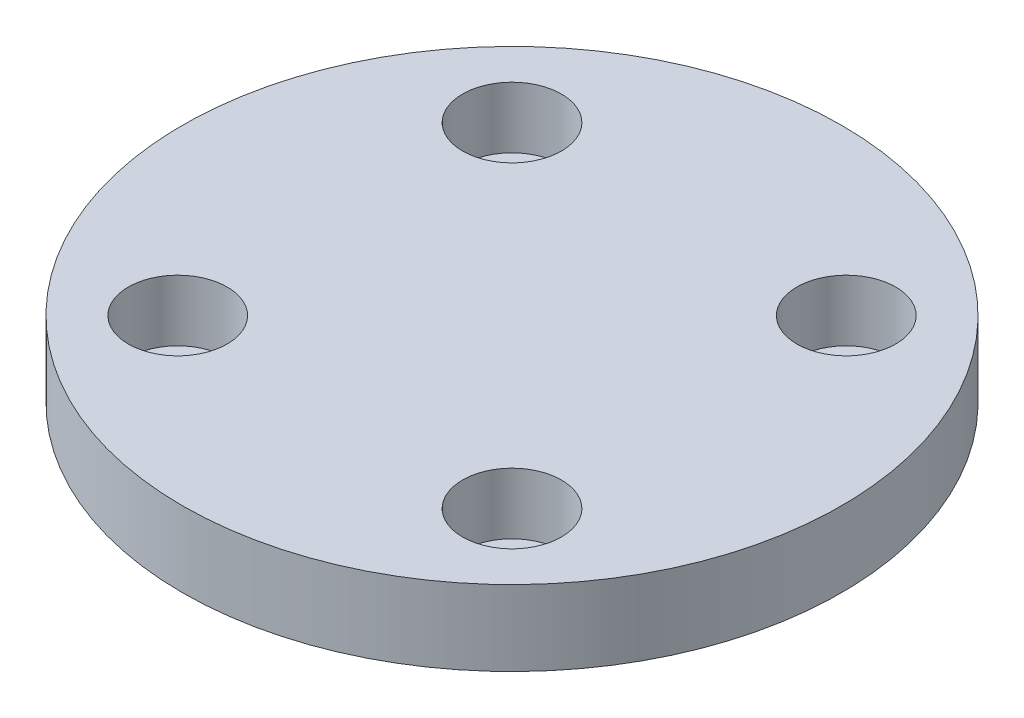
from build123d import *

# Parameters (mm, degrees)
SKETCH1_R           = 35
BOSS_EXTRUDE1_DEPTH = 8
SKETCH2_R           = 5.25
CUT_EXTRUDE1_DEPTH  = 6.5
SKETCH3_R           = 3.25
CUT_EXTRUDE2_DEPTH  = 2


with BuildPart() as part:
    # Sketch1 → Boss-Extrude1 (new body)
    with BuildSketch(Plane(origin=(0, 0, 0), x_dir=(1, 0, 0), z_dir=(0, 1, 0))):
        with Locations(Location((0, 0, 0), (0, 0, 270))):
            Circle(SKETCH1_R)
    extrude(amount=BOSS_EXTRUDE1_DEPTH)

    # Sketch2 → Cut-Extrude1 (cut)
    with BuildSketch(Plane(origin=(0, 8, 0), x_dir=(1, 0, 0), z_dir=(0, 1, 0))):
        with Locations(Location((-17.75, 17.75, 0), (0, 0, 270))):
            Circle(SKETCH2_R)
        with Locations(Location((17.75, 17.75, 0), (0, 0, 270))):
            Circle(SKETCH2_R)
        with Locations(Location((17.75, -17.75, 0), (0, 0, 270))):
            Circle(SKETCH2_R)
        with Locations(Location((-17.75, -17.75, 0), (0, 0, 270))):
            Circle(SKETCH2_R)
    extrude(amount=-CUT_EXTRUDE1_DEPTH, mode=Mode.SUBTRACT)

    # Sketch3 → Cut-Extrude2 (cut)
    with BuildSketch(Plane(origin=(0, 1.5, 0), x_dir=(1, 0, 0), z_dir=(0, 1, 0))):
        with Locations(Location((17.75, 17.75, 0), (0, 0, 270))):
            Circle(SKETCH3_R)
        with Locations(Location((-17.75, 17.75, 0), (0, 0, 270))):
            Circle(SKETCH3_R)
        with Locations(Location((-17.75, -17.75, 0), (0, 0, 270))):
            Circle(SKETCH3_R)
        with Locations(Location((17.75, -17.75, 0), (0, 0, 270))):
            Circle(SKETCH3_R)
    extrude(amount=-CUT_EXTRUDE2_DEPTH, mode=Mode.SUBTRACT)


solid = part.part
